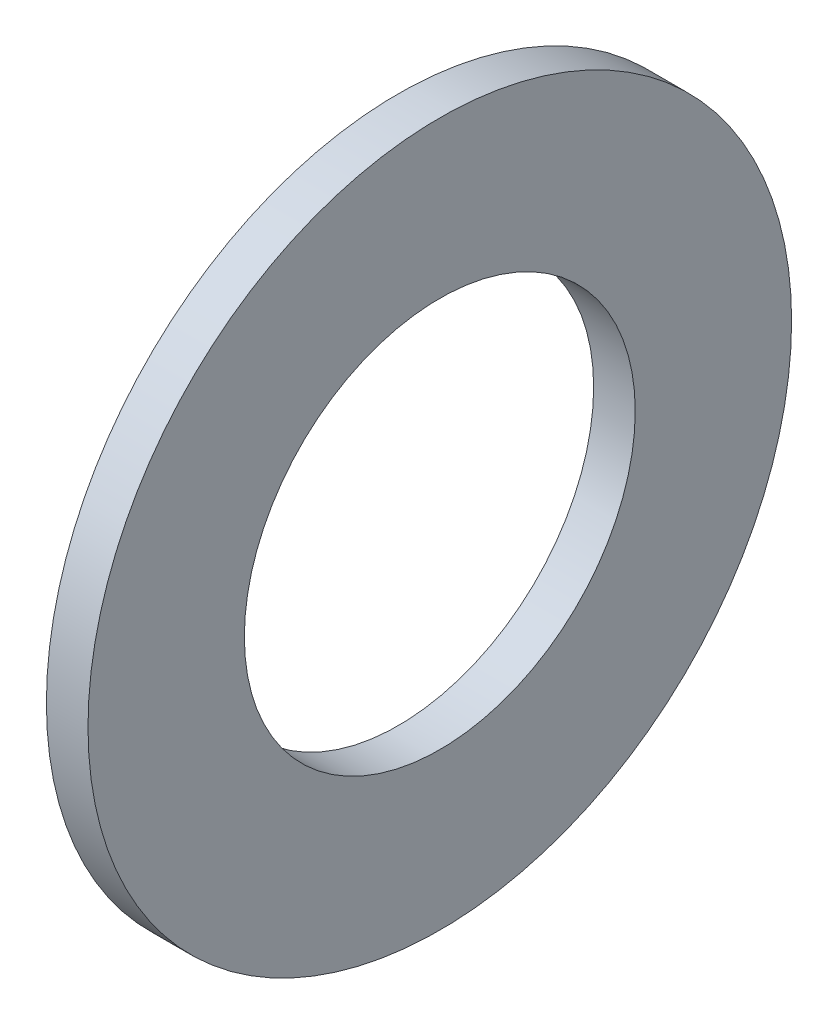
ISO-10303-21;
HEADER;
FILE_DESCRIPTION(('STEP AP214'),'2;1');
FILE_NAME('part.step','',(''),(''),'','','');
FILE_SCHEMA(('AUTOMOTIVE_DESIGN { 1 0 10303 214 1 1 1 1 }'));
ENDSEC;
DATA;
#1=APPLICATION_CONTEXT('core data for automotive mechanical design processes');
#2=APPLICATION_PROTOCOL_DEFINITION('international standard','automotive_design',2000,#1);
#3=PRODUCT_CONTEXT('',#1,'mechanical');
#4=PRODUCT('Part','Part','',(#3));
#5=PRODUCT_RELATED_PRODUCT_CATEGORY('part','',(#4));
#6=PRODUCT_DEFINITION_FORMATION('','',#4);
#7=PRODUCT_DEFINITION_CONTEXT('part definition',#1,'design');
#8=PRODUCT_DEFINITION('design','',#6,#7);
#9=PRODUCT_DEFINITION_SHAPE('','',#8);
#10=(LENGTH_UNIT() NAMED_UNIT(*) SI_UNIT(.MILLI.,.METRE.));
#11=(NAMED_UNIT(*) PLANE_ANGLE_UNIT() SI_UNIT($,.RADIAN.));
#12=(NAMED_UNIT(*) SI_UNIT($,.STERADIAN.) SOLID_ANGLE_UNIT());
#13=UNCERTAINTY_MEASURE_WITH_UNIT(LENGTH_MEASURE(1.E-05),#10,'distance_accuracy_value','');
#14=(GEOMETRIC_REPRESENTATION_CONTEXT(3) GLOBAL_UNCERTAINTY_ASSIGNED_CONTEXT((#13)) GLOBAL_UNIT_ASSIGNED_CONTEXT((#10,
#11,#12)) REPRESENTATION_CONTEXT('',''));
#15=CARTESIAN_POINT('',(0.,0.,0.));
#16=DIRECTION('',(0.,0.,1.));
#17=DIRECTION('',(1.,0.,0.));
#18=AXIS2_PLACEMENT_3D('',#15,#16,#17);
#19=CARTESIAN_POINT('',(0.,0.,-22.5));
#20=DIRECTION('',(1.,0.,0.));
#21=DIRECTION('',(0.,0.,-1.00000000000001));
#22=AXIS2_PLACEMENT_3D('',#19,#20,#21);
#23=PLANE('',#22);
#24=CARTESIAN_POINT('',(0.,0.,0.));
#25=DIRECTION('',(-1.,0.,0.));
#26=DIRECTION('',(0.,0.,1.00000000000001));
#27=AXIS2_PLACEMENT_3D('',#24,#25,#26);
#28=CIRCLE('',#27,12.5);
#29=CARTESIAN_POINT('',(0.,0.,12.5000000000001));
#30=VERTEX_POINT('',#29);
#31=EDGE_CURVE('E10',#30,#30,#28,.T.);
#32=ORIENTED_EDGE('',*,*,#31,.F.);
#33=EDGE_LOOP('',(#32));
#34=FACE_BOUND('',#33,.T.);
#35=CARTESIAN_POINT('',(0.,0.,0.));
#36=DIRECTION('',(-1.,0.,0.));
#37=DIRECTION('',(0.,0.,1.00000000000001));
#38=AXIS2_PLACEMENT_3D('',#35,#36,#37);
#39=CIRCLE('',#38,22.5);
#40=CARTESIAN_POINT('',(0.,0.,22.5000000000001));
#41=VERTEX_POINT('',#40);
#42=EDGE_CURVE('E44',#41,#41,#39,.T.);
#43=ORIENTED_EDGE('',*,*,#42,.T.);
#44=EDGE_LOOP('',(#43));
#45=FACE_BOUND('',#44,.T.);
#46=ADVANCED_FACE('F30',(#34,#45),#23,.F.);
#47=CARTESIAN_POINT('',(0.,0.,0.));
#48=DIRECTION('',(-1.,0.,0.));
#49=DIRECTION('',(0.,0.,1.00000000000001));
#50=AXIS2_PLACEMENT_3D('',#47,#48,#49);
#51=CYLINDRICAL_SURFACE('',#50,12.5);
#52=CARTESIAN_POINT('',(2.66,0.,0.));
#53=DIRECTION('',(-1.,0.,0.));
#54=DIRECTION('',(0.,0.,1.00000000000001));
#55=AXIS2_PLACEMENT_3D('',#52,#53,#54);
#56=CIRCLE('',#55,12.5);
#57=CARTESIAN_POINT('',(2.66,0.,12.5));
#58=VERTEX_POINT('',#57);
#59=EDGE_CURVE('E36',#58,#58,#56,.T.);
#60=ORIENTED_EDGE('',*,*,#59,.F.);
#61=EDGE_LOOP('',(#60));
#62=FACE_BOUND('',#61,.T.);
#63=ORIENTED_EDGE('',*,*,#31,.T.);
#64=EDGE_LOOP('',(#63));
#65=FACE_BOUND('',#64,.T.);
#66=ADVANCED_FACE('F59',(#62,#65),#51,.F.);
#67=CARTESIAN_POINT('',(2.66,1.2490009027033E-13,-22.5000000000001));
#68=DIRECTION('',(-1.,0.,0.));
#69=DIRECTION('',(0.,0.,1.00000000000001));
#70=AXIS2_PLACEMENT_3D('',#67,#68,#69);
#71=PLANE('',#70);
#72=CARTESIAN_POINT('',(2.66,0.,0.));
#73=DIRECTION('',(-1.,0.,0.));
#74=DIRECTION('',(0.,0.,1.00000000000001));
#75=AXIS2_PLACEMENT_3D('',#72,#73,#74);
#76=CIRCLE('',#75,22.5);
#77=CARTESIAN_POINT('',(2.66,0.,22.5000000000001));
#78=VERTEX_POINT('',#77);
#79=EDGE_CURVE('E40',#78,#78,#76,.T.);
#80=ORIENTED_EDGE('',*,*,#79,.F.);
#81=EDGE_LOOP('',(#80));
#82=FACE_BOUND('',#81,.T.);
#83=ORIENTED_EDGE('',*,*,#59,.T.);
#84=EDGE_LOOP('',(#83));
#85=FACE_BOUND('',#84,.T.);
#86=ADVANCED_FACE('F54',(#82,#85),#71,.F.);
#87=CARTESIAN_POINT('',(0.,0.,0.));
#88=DIRECTION('',(-1.,0.,0.));
#89=DIRECTION('',(0.,0.,1.00000000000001));
#90=AXIS2_PLACEMENT_3D('',#87,#88,#89);
#91=CYLINDRICAL_SURFACE('',#90,22.5);
#92=ORIENTED_EDGE('',*,*,#42,.F.);
#93=EDGE_LOOP('',(#92));
#94=FACE_BOUND('',#93,.T.);
#95=ORIENTED_EDGE('',*,*,#79,.T.);
#96=EDGE_LOOP('',(#95));
#97=FACE_BOUND('',#96,.T.);
#98=ADVANCED_FACE('F51',(#94,#97),#91,.T.);
#99=CLOSED_SHELL('',(#46,#66,#86,#98));
#100=MANIFOLD_SOLID_BREP('B2',#99);
#101=ADVANCED_BREP_SHAPE_REPRESENTATION('',(#18,#100),#14);
#102=SHAPE_DEFINITION_REPRESENTATION(#9,#101);
ENDSEC;
END-ISO-10303-21;
